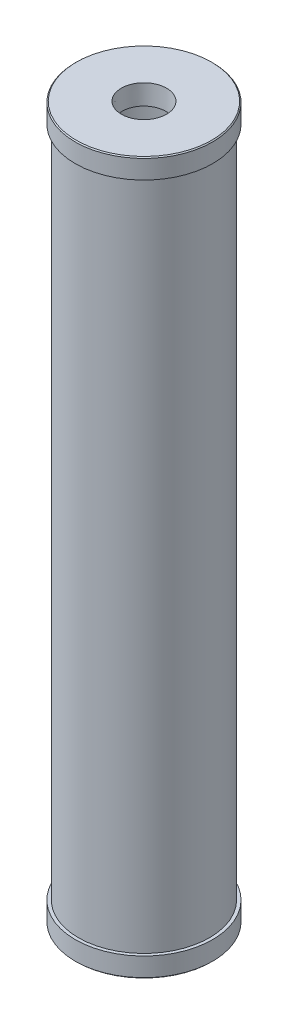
from build123d import *

# Parameters (mm, degrees)
SKETCH1_R           = 84.201
SKETCH1_R_2         = 74.676
BOSS_EXTRUDE1_DEPTH = 914.4
SKETCH2_R           = 88.265
BOSS_EXTRUDE2_DEPTH = 25.4
BOSS_EXTRUDE3_START = -25.4
SKETCH3_R           = 88.265
BOSS_EXTRUDE3_DEPTH = 25.4
CHAMFER1_SIZE       = 1.27


with BuildPart() as part:
    # Sketch1 → Boss-Extrude1 (new body)
    with BuildSketch(Plane(origin=(0, 0, 0), x_dir=(1, 0, 0), z_dir=(0, 1, 0))):
        with Locations(Location((0, 0, 0), (0, 0, 270))):
            Circle(SKETCH1_R)
        with Locations(Location((0, 0, 0), (0, 0, 270))):
            Circle(SKETCH1_R_2, mode=Mode.SUBTRACT)
    extrude(amount=BOSS_EXTRUDE1_DEPTH)

    # Sketch2 → Boss-Extrude2 (add)
    with BuildSketch(Plane(origin=(0, 0, 0), x_dir=(1, 0, 0), z_dir=(0, 1, 0))):
        with Locations(Location((0, 0, 0), (0, 0, 270))):
            Circle(SKETCH2_R)
    extrude(amount=BOSS_EXTRUDE2_DEPTH)

    # Sketch3 → Boss-Extrude3 (add)
    with BuildSketch(Plane(origin=(0, 914.4, 0), x_dir=(1, 0, 0), z_dir=(0, 1, 0)).offset(BOSS_EXTRUDE3_START)):
        with Locations(Location((0, 0, 0), (0, 0, 270))):
            Circle(SKETCH3_R)
    extrude(amount=BOSS_EXTRUDE3_DEPTH)

    # Sketch4 → 2 Rc Tapped Hole1 (revolve, cut)
    with BuildSketch(Plane(origin=(0, 914.4, 0), x_dir=(0, 0, 1), z_dir=(1, 0, 0))):
        Polygon((0, 0), (0, 53.547580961), (27.4, 37.084), (27.4, 25.654), (28.265232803, 25.654), (29.066064, 0), align=None)
    revolve(axis=Axis((0, 920.75, 0), (0, -1, 0)), mode=Mode.SUBTRACT)

    # Sketch10 → 2 Rc Tapped Hole2 (revolve, cut)
    with BuildSketch(Plane(origin=(0, 0, 0), x_dir=(0, 0, -1), z_dir=(1, 0, 0))):
        Polygon((0, 0), (0, 53.547580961), (27.4, 37.084), (27.4, 25.654), (28.265232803, 25.654), (29.066064, 0), align=None)
    revolve(axis=Axis((0, -6.35, 0), (0, 1, 0)), mode=Mode.SUBTRACT)

    # Chamfer1
    chamfer1_edges = [part.edges().sort_by_distance(p)[0] for p in [
        (0, 0, -88.265),
        (0, 914.4, -88.265),
    ]]
    chamfer(chamfer1_edges, length=CHAMFER1_SIZE)


solid = part.part
